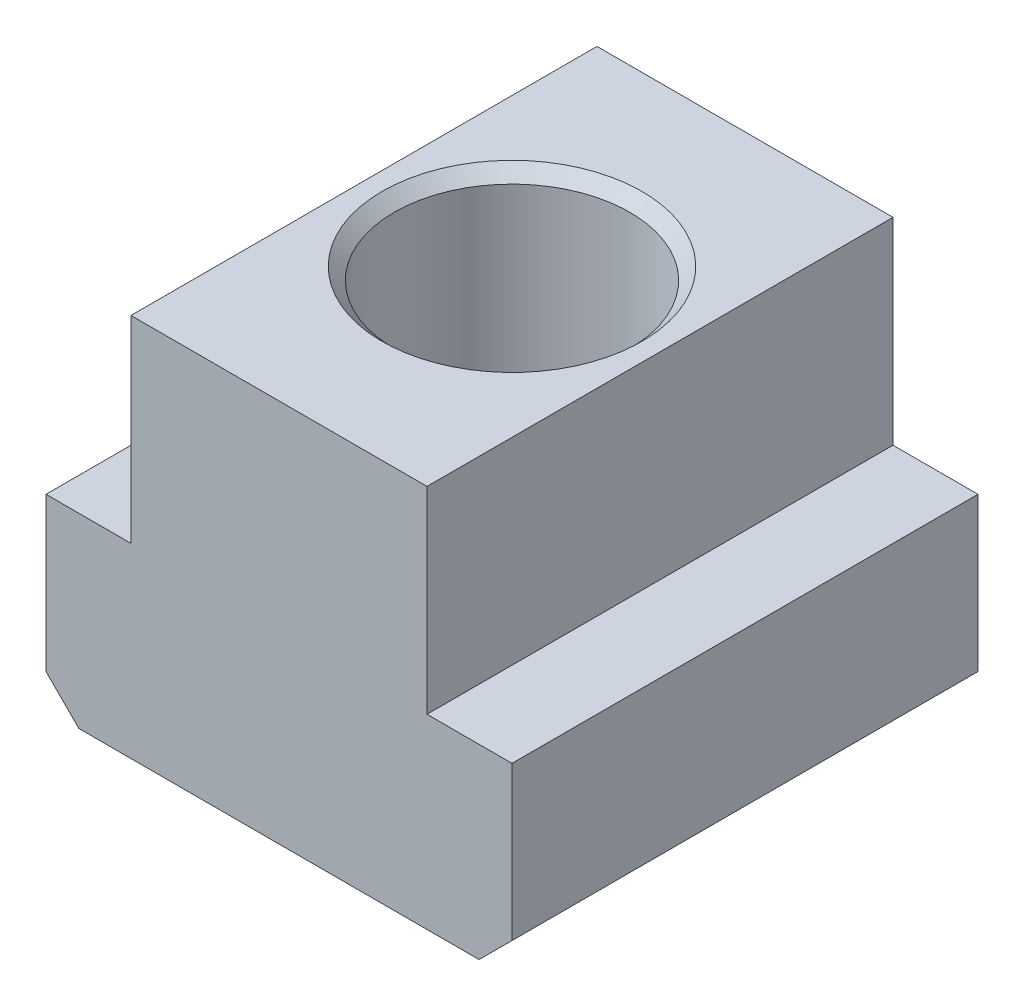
ISO-10303-21;
HEADER;
FILE_DESCRIPTION(('STEP AP214'),'2;1');
FILE_NAME('part.step','',(''),(''),'','','');
FILE_SCHEMA(('AUTOMOTIVE_DESIGN { 1 0 10303 214 1 1 1 1 }'));
ENDSEC;
DATA;
#1=APPLICATION_CONTEXT('core data for automotive mechanical design processes');
#2=APPLICATION_PROTOCOL_DEFINITION('international standard','automotive_design',2000,#1);
#3=PRODUCT_CONTEXT('',#1,'mechanical');
#4=PRODUCT('Part','Part','',(#3));
#5=PRODUCT_RELATED_PRODUCT_CATEGORY('part','',(#4));
#6=PRODUCT_DEFINITION_FORMATION('','',#4);
#7=PRODUCT_DEFINITION_CONTEXT('part definition',#1,'design');
#8=PRODUCT_DEFINITION('design','',#6,#7);
#9=PRODUCT_DEFINITION_SHAPE('','',#8);
#10=(LENGTH_UNIT() NAMED_UNIT(*) SI_UNIT(.MILLI.,.METRE.));
#11=(NAMED_UNIT(*) PLANE_ANGLE_UNIT() SI_UNIT($,.RADIAN.));
#12=(NAMED_UNIT(*) SI_UNIT($,.STERADIAN.) SOLID_ANGLE_UNIT());
#13=UNCERTAINTY_MEASURE_WITH_UNIT(LENGTH_MEASURE(1.E-05),#10,'distance_accuracy_value','');
#14=(GEOMETRIC_REPRESENTATION_CONTEXT(3) GLOBAL_UNCERTAINTY_ASSIGNED_CONTEXT((#13)) GLOBAL_UNIT_ASSIGNED_CONTEXT((#10,
#11,#12)) REPRESENTATION_CONTEXT('',''));
#15=CARTESIAN_POINT('',(0.,0.,0.));
#16=DIRECTION('',(0.,0.,1.));
#17=DIRECTION('',(1.,0.,0.));
#18=AXIS2_PLACEMENT_3D('',#15,#16,#17);
#19=CARTESIAN_POINT('',(-42.5,0.,-85.));
#20=DIRECTION('',(-1.,0.,0.));
#21=DIRECTION('',(0.,0.,1.));
#22=AXIS2_PLACEMENT_3D('',#19,#20,#21);
#23=PLANE('',#22);
#24=DIRECTION('',(0.,-1.,0.));
#25=VECTOR('',#24,1.);
#26=CARTESIAN_POINT('',(-42.5,0.,-85.));
#27=LINE('',#26,#25);
#28=CARTESIAN_POINT('',(-42.5,34.,-85.));
#29=VERTEX_POINT('',#28);
#30=CARTESIAN_POINT('',(-42.5,6.0000000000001,-85.));
#31=VERTEX_POINT('',#30);
#32=EDGE_CURVE('E173',#29,#31,#27,.T.);
#33=ORIENTED_EDGE('',*,*,#32,.T.);
#34=DIRECTION('',(0.,0.,1.));
#35=VECTOR('',#34,1.);
#36=CARTESIAN_POINT('',(-42.5,6.0000000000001,-85.));
#37=LINE('',#36,#35);
#38=CARTESIAN_POINT('',(-42.5,6.0000000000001,0.));
#39=VERTEX_POINT('',#38);
#40=EDGE_CURVE('E196',#31,#39,#37,.T.);
#41=ORIENTED_EDGE('',*,*,#40,.T.);
#42=DIRECTION('',(0.,-1.,0.));
#43=VECTOR('',#42,1.);
#44=CARTESIAN_POINT('',(-42.5,0.,0.));
#45=LINE('',#44,#43);
#46=CARTESIAN_POINT('',(-42.5,34.,0.));
#47=VERTEX_POINT('',#46);
#48=EDGE_CURVE('E152',#47,#39,#45,.T.);
#49=ORIENTED_EDGE('',*,*,#48,.F.);
#50=DIRECTION('',(0.,0.,1.));
#51=VECTOR('',#50,1.);
#52=CARTESIAN_POINT('',(-42.5,34.,-85.));
#53=LINE('',#52,#51);
#54=EDGE_CURVE('E174',#29,#47,#53,.T.);
#55=ORIENTED_EDGE('',*,*,#54,.F.);
#56=EDGE_LOOP('',(#33,#41,#49,#55));
#57=FACE_BOUND('',#56,.T.);
#58=ADVANCED_FACE('F39',(#57),#23,.T.);
#59=CARTESIAN_POINT('',(-42.5,34.,-85.));
#60=DIRECTION('',(0.,1.,0.));
#61=DIRECTION('',(0.,0.,1.));
#62=AXIS2_PLACEMENT_3D('',#59,#60,#61);
#63=PLANE('',#62);
#64=DIRECTION('',(-1.,0.,0.));
#65=VECTOR('',#64,1.);
#66=CARTESIAN_POINT('',(-42.5,34.,0.));
#67=LINE('',#66,#65);
#68=CARTESIAN_POINT('',(-27.,34.,0.));
#69=VERTEX_POINT('',#68);
#70=EDGE_CURVE('E170',#69,#47,#67,.T.);
#71=ORIENTED_EDGE('',*,*,#70,.F.);
#72=DIRECTION('',(0.,0.,1.));
#73=VECTOR('',#72,1.);
#74=CARTESIAN_POINT('',(-27.,34.,-85.));
#75=LINE('',#74,#73);
#76=CARTESIAN_POINT('',(-27.,34.,-85.));
#77=VERTEX_POINT('',#76);
#78=EDGE_CURVE('E177',#77,#69,#75,.T.);
#79=ORIENTED_EDGE('',*,*,#78,.F.);
#80=DIRECTION('',(-1.,0.,0.));
#81=VECTOR('',#80,1.);
#82=CARTESIAN_POINT('',(-42.5,34.,-85.));
#83=LINE('',#82,#81);
#84=EDGE_CURVE('E133',#77,#29,#83,.T.);
#85=ORIENTED_EDGE('',*,*,#84,.T.);
#86=ORIENTED_EDGE('',*,*,#54,.T.);
#87=EDGE_LOOP('',(#71,#79,#85,#86));
#88=FACE_BOUND('',#87,.T.);
#89=ADVANCED_FACE('F245',(#88),#63,.T.);
#90=CARTESIAN_POINT('',(-27.,34.,-85.));
#91=DIRECTION('',(-1.,0.,0.));
#92=DIRECTION('',(0.,0.,1.));
#93=AXIS2_PLACEMENT_3D('',#90,#91,#92);
#94=PLANE('',#93);
#95=DIRECTION('',(0.,-1.,0.));
#96=VECTOR('',#95,1.);
#97=CARTESIAN_POINT('',(-27.,34.,0.));
#98=LINE('',#97,#96);
#99=CARTESIAN_POINT('',(-27.,70.,0.));
#100=VERTEX_POINT('',#99);
#101=EDGE_CURVE('E167',#100,#69,#98,.T.);
#102=ORIENTED_EDGE('',*,*,#101,.F.);
#103=DIRECTION('',(0.,0.,1.));
#104=VECTOR('',#103,1.);
#105=CARTESIAN_POINT('',(-27.,70.,-85.));
#106=LINE('',#105,#104);
#107=CARTESIAN_POINT('',(-27.,70.,-85.));
#108=VERTEX_POINT('',#107);
#109=EDGE_CURVE('E179',#108,#100,#106,.T.);
#110=ORIENTED_EDGE('',*,*,#109,.F.);
#111=DIRECTION('',(0.,-1.,0.));
#112=VECTOR('',#111,1.);
#113=CARTESIAN_POINT('',(-27.,34.,-85.));
#114=LINE('',#113,#112);
#115=EDGE_CURVE('E147',#108,#77,#114,.T.);
#116=ORIENTED_EDGE('',*,*,#115,.T.);
#117=ORIENTED_EDGE('',*,*,#78,.T.);
#118=EDGE_LOOP('',(#102,#110,#116,#117));
#119=FACE_BOUND('',#118,.T.);
#120=ADVANCED_FACE('F262',(#119),#94,.T.);
#121=CARTESIAN_POINT('',(-27.,70.,-85.));
#122=DIRECTION('',(0.,1.,0.));
#123=DIRECTION('',(0.,0.,1.));
#124=AXIS2_PLACEMENT_3D('',#121,#122,#123);
#125=PLANE('',#124);
#126=CARTESIAN_POINT('',(0.,70.,-42.5));
#127=DIRECTION('',(0.,1.,0.));
#128=DIRECTION('',(0.,0.,1.));
#129=AXIS2_PLACEMENT_3D('',#126,#127,#128);
#130=CIRCLE('',#129,23.7);
#131=CARTESIAN_POINT('',(-23.7,70.,-42.5));
#132=VERTEX_POINT('',#131);
#133=EDGE_CURVE('E47',#132,#132,#130,.F.);
#134=ORIENTED_EDGE('',*,*,#133,.T.);
#135=EDGE_LOOP('',(#134));
#136=FACE_BOUND('',#135,.T.);
#137=DIRECTION('',(-1.,0.,0.));
#138=VECTOR('',#137,1.);
#139=CARTESIAN_POINT('',(-27.,70.,0.));
#140=LINE('',#139,#138);
#141=CARTESIAN_POINT('',(27.,70.,0.));
#142=VERTEX_POINT('',#141);
#143=EDGE_CURVE('E164',#142,#100,#140,.T.);
#144=ORIENTED_EDGE('',*,*,#143,.F.);
#145=DIRECTION('',(0.,0.,1.));
#146=VECTOR('',#145,1.);
#147=CARTESIAN_POINT('',(27.,70.,-85.));
#148=LINE('',#147,#146);
#149=CARTESIAN_POINT('',(27.,70.,-85.));
#150=VERTEX_POINT('',#149);
#151=EDGE_CURVE('E181',#150,#142,#148,.T.);
#152=ORIENTED_EDGE('',*,*,#151,.F.);
#153=DIRECTION('',(-1.,0.,0.));
#154=VECTOR('',#153,1.);
#155=CARTESIAN_POINT('',(-27.,70.,-85.));
#156=LINE('',#155,#154);
#157=EDGE_CURVE('E141',#150,#108,#156,.T.);
#158=ORIENTED_EDGE('',*,*,#157,.T.);
#159=ORIENTED_EDGE('',*,*,#109,.T.);
#160=EDGE_LOOP('',(#144,#152,#158,#159));
#161=FACE_BOUND('',#160,.T.);
#162=ADVANCED_FACE('F207',(#136,#161),#125,.T.);
#163=CARTESIAN_POINT('',(27.,34.,-85.));
#164=DIRECTION('',(1.,0.,0.));
#165=DIRECTION('',(0.,1.,0.));
#166=AXIS2_PLACEMENT_3D('',#163,#164,#165);
#167=PLANE('',#166);
#168=DIRECTION('',(0.,1.,0.));
#169=VECTOR('',#168,1.);
#170=CARTESIAN_POINT('',(27.,34.,0.));
#171=LINE('',#170,#169);
#172=CARTESIAN_POINT('',(27.,34.,0.));
#173=VERTEX_POINT('',#172);
#174=EDGE_CURVE('E161',#173,#142,#171,.T.);
#175=ORIENTED_EDGE('',*,*,#174,.F.);
#176=DIRECTION('',(0.,0.,1.));
#177=VECTOR('',#176,1.);
#178=CARTESIAN_POINT('',(27.,34.,-85.));
#179=LINE('',#178,#177);
#180=CARTESIAN_POINT('',(27.,34.,-85.));
#181=VERTEX_POINT('',#180);
#182=EDGE_CURVE('E132',#181,#173,#179,.T.);
#183=ORIENTED_EDGE('',*,*,#182,.F.);
#184=DIRECTION('',(0.,1.,0.));
#185=VECTOR('',#184,1.);
#186=CARTESIAN_POINT('',(27.,34.,-85.));
#187=LINE('',#186,#185);
#188=EDGE_CURVE('E139',#181,#150,#187,.T.);
#189=ORIENTED_EDGE('',*,*,#188,.T.);
#190=ORIENTED_EDGE('',*,*,#151,.T.);
#191=EDGE_LOOP('',(#175,#183,#189,#190));
#192=FACE_BOUND('',#191,.T.);
#193=ADVANCED_FACE('F253',(#192),#167,.T.);
#194=CARTESIAN_POINT('',(27.,34.,-85.));
#195=DIRECTION('',(0.,1.,0.));
#196=DIRECTION('',(0.,0.,1.));
#197=AXIS2_PLACEMENT_3D('',#194,#195,#196);
#198=PLANE('',#197);
#199=DIRECTION('',(-1.,0.,0.));
#200=VECTOR('',#199,1.);
#201=CARTESIAN_POINT('',(27.,34.,0.));
#202=LINE('',#201,#200);
#203=CARTESIAN_POINT('',(42.5,34.,0.));
#204=VERTEX_POINT('',#203);
#205=EDGE_CURVE('E131',#204,#173,#202,.T.);
#206=ORIENTED_EDGE('',*,*,#205,.F.);
#207=DIRECTION('',(0.,0.,1.));
#208=VECTOR('',#207,1.);
#209=CARTESIAN_POINT('',(42.5,34.,-85.));
#210=LINE('',#209,#208);
#211=CARTESIAN_POINT('',(42.5,34.,-85.));
#212=VERTEX_POINT('',#211);
#213=EDGE_CURVE('E120',#212,#204,#210,.T.);
#214=ORIENTED_EDGE('',*,*,#213,.F.);
#215=DIRECTION('',(-1.,0.,0.));
#216=VECTOR('',#215,1.);
#217=CARTESIAN_POINT('',(27.,34.,-85.));
#218=LINE('',#217,#216);
#219=EDGE_CURVE('E124',#212,#181,#218,.T.);
#220=ORIENTED_EDGE('',*,*,#219,.T.);
#221=ORIENTED_EDGE('',*,*,#182,.T.);
#222=EDGE_LOOP('',(#206,#214,#220,#221));
#223=FACE_BOUND('',#222,.T.);
#224=ADVANCED_FACE('F129',(#223),#198,.T.);
#225=CARTESIAN_POINT('',(42.5,0.,-85.));
#226=DIRECTION('',(1.,0.,0.));
#227=DIRECTION('',(0.,1.,0.));
#228=AXIS2_PLACEMENT_3D('',#225,#226,#227);
#229=PLANE('',#228);
#230=DIRECTION('',(0.,1.,0.));
#231=VECTOR('',#230,1.);
#232=CARTESIAN_POINT('',(42.5,0.,0.));
#233=LINE('',#232,#231);
#234=CARTESIAN_POINT('',(42.5,6.00000000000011,0.));
#235=VERTEX_POINT('',#234);
#236=EDGE_CURVE('E158',#235,#204,#233,.T.);
#237=ORIENTED_EDGE('',*,*,#236,.F.);
#238=DIRECTION('',(0.,0.,-1.));
#239=VECTOR('',#238,1.);
#240=CARTESIAN_POINT('',(42.5,6.00000000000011,-85.));
#241=LINE('',#240,#239);
#242=CARTESIAN_POINT('',(42.5,6.00000000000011,-85.));
#243=VERTEX_POINT('',#242);
#244=EDGE_CURVE('E62',#235,#243,#241,.T.);
#245=ORIENTED_EDGE('',*,*,#244,.T.);
#246=DIRECTION('',(0.,1.,0.));
#247=VECTOR('',#246,1.);
#248=CARTESIAN_POINT('',(42.5,0.,-85.));
#249=LINE('',#248,#247);
#250=EDGE_CURVE('E117',#243,#212,#249,.T.);
#251=ORIENTED_EDGE('',*,*,#250,.T.);
#252=ORIENTED_EDGE('',*,*,#213,.T.);
#253=EDGE_LOOP('',(#237,#245,#251,#252));
#254=FACE_BOUND('',#253,.T.);
#255=ADVANCED_FACE('F119',(#254),#229,.T.);
#256=CARTESIAN_POINT('',(-42.5,0.,-85.));
#257=DIRECTION('',(0.,-1.,0.));
#258=DIRECTION('',(1.,0.,0.));
#259=AXIS2_PLACEMENT_3D('',#256,#257,#258);
#260=PLANE('',#259);
#261=CARTESIAN_POINT('',(0.,0.,-42.5));
#262=DIRECTION('',(0.,-1.,0.));
#263=DIRECTION('',(1.,0.,0.));
#264=AXIS2_PLACEMENT_3D('',#261,#262,#263);
#265=CIRCLE('',#264,23.7);
#266=CARTESIAN_POINT('',(23.7,0.,-42.5));
#267=VERTEX_POINT('',#266);
#268=EDGE_CURVE('E11',#267,#267,#265,.F.);
#269=ORIENTED_EDGE('',*,*,#268,.T.);
#270=EDGE_LOOP('',(#269));
#271=FACE_BOUND('',#270,.T.);
#272=DIRECTION('',(1.,0.,0.));
#273=VECTOR('',#272,1.);
#274=CARTESIAN_POINT('',(-42.5,0.,-85.));
#275=LINE('',#274,#273);
#276=CARTESIAN_POINT('',(-36.5,0.,-85.));
#277=VERTEX_POINT('',#276);
#278=CARTESIAN_POINT('',(36.5,0.,-85.));
#279=VERTEX_POINT('',#278);
#280=EDGE_CURVE('E125',#277,#279,#275,.T.);
#281=ORIENTED_EDGE('',*,*,#280,.T.);
#282=DIRECTION('',(0.,0.,1.));
#283=VECTOR('',#282,1.);
#284=CARTESIAN_POINT('',(36.5,0.,-85.));
#285=LINE('',#284,#283);
#286=CARTESIAN_POINT('',(36.5,0.,0.));
#287=VERTEX_POINT('',#286);
#288=EDGE_CURVE('E185',#279,#287,#285,.T.);
#289=ORIENTED_EDGE('',*,*,#288,.T.);
#290=DIRECTION('',(1.,0.,0.));
#291=VECTOR('',#290,1.);
#292=CARTESIAN_POINT('',(-42.5,0.,0.));
#293=LINE('',#292,#291);
#294=CARTESIAN_POINT('',(-36.5,0.,0.));
#295=VERTEX_POINT('',#294);
#296=EDGE_CURVE('E155',#295,#287,#293,.T.);
#297=ORIENTED_EDGE('',*,*,#296,.F.);
#298=DIRECTION('',(0.,0.,-1.));
#299=VECTOR('',#298,1.);
#300=CARTESIAN_POINT('',(-36.5,0.,-85.));
#301=LINE('',#300,#299);
#302=EDGE_CURVE('E176',#295,#277,#301,.T.);
#303=ORIENTED_EDGE('',*,*,#302,.T.);
#304=EDGE_LOOP('',(#281,#289,#297,#303));
#305=FACE_BOUND('',#304,.T.);
#306=ADVANCED_FACE('F226',(#271,#305),#260,.T.);
#307=CARTESIAN_POINT('',(-42.5,34.,-85.));
#308=DIRECTION('',(0.,0.,-1.));
#309=DIRECTION('',(-1.,0.,0.));
#310=AXIS2_PLACEMENT_3D('',#307,#308,#309);
#311=PLANE('',#310);
#312=ORIENTED_EDGE('',*,*,#250,.F.);
#313=DIRECTION('',(0.707106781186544,0.707106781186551,0.));
#314=VECTOR('',#313,1.);
#315=CARTESIAN_POINT('',(14.0000000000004,-22.4999999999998,-85.));
#316=LINE('',#315,#314);
#317=EDGE_CURVE('E194',#243,#279,#316,.F.);
#318=ORIENTED_EDGE('',*,*,#317,.T.);
#319=ORIENTED_EDGE('',*,*,#280,.F.);
#320=DIRECTION('',(0.707106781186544,-0.707106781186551,0.));
#321=VECTOR('',#320,1.);
#322=CARTESIAN_POINT('',(-56.5,20.0000000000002,-85.));
#323=LINE('',#322,#321);
#324=EDGE_CURVE('E54',#277,#31,#323,.F.);
#325=ORIENTED_EDGE('',*,*,#324,.T.);
#326=ORIENTED_EDGE('',*,*,#32,.F.);
#327=ORIENTED_EDGE('',*,*,#84,.F.);
#328=ORIENTED_EDGE('',*,*,#115,.F.);
#329=ORIENTED_EDGE('',*,*,#157,.F.);
#330=ORIENTED_EDGE('',*,*,#188,.F.);
#331=ORIENTED_EDGE('',*,*,#219,.F.);
#332=EDGE_LOOP('',(#312,#318,#319,#325,#326,#327,#328,#329,#330,#331));
#333=FACE_BOUND('',#332,.T.);
#334=ADVANCED_FACE('F136',(#333),#311,.T.);
#335=CARTESIAN_POINT('',(-42.5,34.,0.));
#336=DIRECTION('',(0.,0.,-1.));
#337=DIRECTION('',(-1.,0.,0.));
#338=AXIS2_PLACEMENT_3D('',#335,#336,#337);
#339=PLANE('',#338);
#340=ORIENTED_EDGE('',*,*,#296,.T.);
#341=DIRECTION('',(-0.707106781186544,-0.707106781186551,0.));
#342=VECTOR('',#341,1.);
#343=CARTESIAN_POINT('',(36.5,0.,0.));
#344=LINE('',#343,#342);
#345=EDGE_CURVE('E190',#287,#235,#344,.F.);
#346=ORIENTED_EDGE('',*,*,#345,.T.);
#347=ORIENTED_EDGE('',*,*,#236,.T.);
#348=ORIENTED_EDGE('',*,*,#205,.T.);
#349=ORIENTED_EDGE('',*,*,#174,.T.);
#350=ORIENTED_EDGE('',*,*,#143,.T.);
#351=ORIENTED_EDGE('',*,*,#101,.T.);
#352=ORIENTED_EDGE('',*,*,#70,.T.);
#353=ORIENTED_EDGE('',*,*,#48,.T.);
#354=DIRECTION('',(-0.707106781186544,0.707106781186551,0.));
#355=VECTOR('',#354,1.);
#356=CARTESIAN_POINT('',(-42.5,6.0000000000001,0.));
#357=LINE('',#356,#355);
#358=EDGE_CURVE('E188',#39,#295,#357,.F.);
#359=ORIENTED_EDGE('',*,*,#358,.T.);
#360=EDGE_LOOP('',(#340,#346,#347,#348,#349,#350,#351,#352,#353,#359));
#361=FACE_BOUND('',#360,.T.);
#362=ADVANCED_FACE('F237',(#361),#339,.F.);
#363=CARTESIAN_POINT('',(36.5,0.,-85.));
#364=DIRECTION('',(-0.707106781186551,0.707106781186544,0.));
#365=DIRECTION('',(-0.707106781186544,-0.707106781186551,0.));
#366=AXIS2_PLACEMENT_3D('',#363,#364,#365);
#367=PLANE('',#366);
#368=ORIENTED_EDGE('',*,*,#317,.F.);
#369=ORIENTED_EDGE('',*,*,#244,.F.);
#370=ORIENTED_EDGE('',*,*,#345,.F.);
#371=ORIENTED_EDGE('',*,*,#288,.F.);
#372=EDGE_LOOP('',(#368,#369,#370,#371));
#373=FACE_BOUND('',#372,.T.);
#374=ADVANCED_FACE('F235',(#373),#367,.F.);
#375=CARTESIAN_POINT('',(-42.5,6.0000000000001,-85.));
#376=DIRECTION('',(0.707106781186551,0.707106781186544,0.));
#377=DIRECTION('',(-0.707106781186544,0.707106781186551,0.));
#378=AXIS2_PLACEMENT_3D('',#375,#376,#377);
#379=PLANE('',#378);
#380=ORIENTED_EDGE('',*,*,#324,.F.);
#381=ORIENTED_EDGE('',*,*,#302,.F.);
#382=ORIENTED_EDGE('',*,*,#358,.F.);
#383=ORIENTED_EDGE('',*,*,#40,.F.);
#384=EDGE_LOOP('',(#380,#381,#382,#383));
#385=FACE_BOUND('',#384,.T.);
#386=ADVANCED_FACE('F218',(#385),#379,.F.);
#387=CARTESIAN_POINT('',(0.,0.,-42.5));
#388=DIRECTION('',(0.,1.,0.));
#389=DIRECTION('',(-1.,0.,0.));
#390=AXIS2_PLACEMENT_3D('',#387,#388,#389);
#391=CYLINDRICAL_SURFACE('',#390,21.5);
#392=CARTESIAN_POINT('',(0.,67.8,-42.5));
#393=DIRECTION('',(0.,1.,0.));
#394=DIRECTION('',(-1.,0.,0.));
#395=AXIS2_PLACEMENT_3D('',#392,#393,#394);
#396=CIRCLE('',#395,21.5);
#397=CARTESIAN_POINT('',(-21.5,67.8,-42.5));
#398=VERTEX_POINT('',#397);
#399=EDGE_CURVE('E202',#398,#398,#396,.T.);
#400=ORIENTED_EDGE('',*,*,#399,.T.);
#401=EDGE_LOOP('',(#400));
#402=FACE_BOUND('',#401,.T.);
#403=CARTESIAN_POINT('',(0.,2.2,-42.5));
#404=DIRECTION('',(0.,-1.,0.));
#405=DIRECTION('',(1.,0.,0.));
#406=AXIS2_PLACEMENT_3D('',#403,#404,#405);
#407=CIRCLE('',#406,21.5);
#408=CARTESIAN_POINT('',(21.5,2.19999999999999,-42.5));
#409=VERTEX_POINT('',#408);
#410=EDGE_CURVE('E199',#409,#409,#407,.T.);
#411=ORIENTED_EDGE('',*,*,#410,.T.);
#412=EDGE_LOOP('',(#411));
#413=FACE_BOUND('',#412,.T.);
#414=ADVANCED_FACE('F213',(#402,#413),#391,.F.);
#415=CARTESIAN_POINT('',(0.,67.8,-42.5));
#416=DIRECTION('',(0.,1.,0.));
#417=DIRECTION('',(-1.,0.,0.));
#418=AXIS2_PLACEMENT_3D('',#415,#416,#417);
#419=CONICAL_SURFACE('',#418,21.5,0.785398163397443);
#420=CARTESIAN_POINT('',(-23.7,70.,-42.5));
#421=CARTESIAN_POINT('',(-23.6770833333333,69.9770833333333,-42.5));
#422=CARTESIAN_POINT('',(-23.6541666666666,69.9541666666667,-42.5));
#423=CARTESIAN_POINT('',(-23.6083333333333,69.9083333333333,-42.5));
#424=CARTESIAN_POINT('',(-23.5854166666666,69.8854166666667,-42.5));
#425=CARTESIAN_POINT('',(-23.5395833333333,69.8395833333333,-42.5));
#426=CARTESIAN_POINT('',(-23.5166666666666,69.8166666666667,-42.5));
#427=CARTESIAN_POINT('',(-23.4708333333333,69.7708333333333,-42.5));
#428=CARTESIAN_POINT('',(-23.4479166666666,69.7479166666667,-42.5));
#429=CARTESIAN_POINT('',(-23.4020833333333,69.7020833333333,-42.5));
#430=CARTESIAN_POINT('',(-23.3791666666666,69.6791666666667,-42.5));
#431=CARTESIAN_POINT('',(-23.3333333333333,69.6333333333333,-42.5));
#432=CARTESIAN_POINT('',(-23.3104166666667,69.6104166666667,-42.5));
#433=CARTESIAN_POINT('',(-23.2645833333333,69.5645833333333,-42.5));
#434=CARTESIAN_POINT('',(-23.2416666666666,69.5416666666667,-42.5));
#435=CARTESIAN_POINT('',(-23.1958333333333,69.4958333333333,-42.5));
#436=CARTESIAN_POINT('',(-23.1729166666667,69.4729166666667,-42.5));
#437=CARTESIAN_POINT('',(-23.1270833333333,69.4270833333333,-42.5));
#438=CARTESIAN_POINT('',(-23.1041666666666,69.4041666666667,-42.5));
#439=CARTESIAN_POINT('',(-23.0583333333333,69.3583333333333,-42.5));
#440=CARTESIAN_POINT('',(-23.0354166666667,69.3354166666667,-42.5));
#441=CARTESIAN_POINT('',(-22.9895833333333,69.2895833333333,-42.5));
#442=CARTESIAN_POINT('',(-22.9666666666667,69.2666666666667,-42.5));
#443=CARTESIAN_POINT('',(-22.9208333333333,69.2208333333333,-42.5));
#444=CARTESIAN_POINT('',(-22.8979166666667,69.1979166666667,-42.5));
#445=CARTESIAN_POINT('',(-22.8520833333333,69.1520833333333,-42.5));
#446=CARTESIAN_POINT('',(-22.8291666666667,69.1291666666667,-42.5));
#447=CARTESIAN_POINT('',(-22.7833333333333,69.0833333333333,-42.5));
#448=CARTESIAN_POINT('',(-22.7604166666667,69.0604166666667,-42.5));
#449=CARTESIAN_POINT('',(-22.7145833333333,69.0145833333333,-42.5));
#450=CARTESIAN_POINT('',(-22.6916666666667,68.9916666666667,-42.5));
#451=CARTESIAN_POINT('',(-22.6458333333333,68.9458333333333,-42.5));
#452=CARTESIAN_POINT('',(-22.6229166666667,68.9229166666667,-42.5));
#453=CARTESIAN_POINT('',(-22.5770833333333,68.8770833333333,-42.5));
#454=CARTESIAN_POINT('',(-22.5541666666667,68.8541666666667,-42.5));
#455=CARTESIAN_POINT('',(-22.5083333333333,68.8083333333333,-42.5));
#456=CARTESIAN_POINT('',(-22.4854166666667,68.7854166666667,-42.5));
#457=CARTESIAN_POINT('',(-22.4395833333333,68.7395833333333,-42.5));
#458=CARTESIAN_POINT('',(-22.4166666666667,68.7166666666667,-42.5));
#459=CARTESIAN_POINT('',(-22.3708333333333,68.6708333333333,-42.5));
#460=CARTESIAN_POINT('',(-22.3479166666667,68.6479166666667,-42.5));
#461=CARTESIAN_POINT('',(-22.3020833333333,68.6020833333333,-42.5));
#462=CARTESIAN_POINT('',(-22.2791666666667,68.5791666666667,-42.5));
#463=CARTESIAN_POINT('',(-22.2333333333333,68.5333333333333,-42.5));
#464=CARTESIAN_POINT('',(-22.2104166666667,68.5104166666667,-42.5));
#465=CARTESIAN_POINT('',(-22.1645833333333,68.4645833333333,-42.5));
#466=CARTESIAN_POINT('',(-22.1416666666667,68.4416666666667,-42.5));
#467=CARTESIAN_POINT('',(-22.0958333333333,68.3958333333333,-42.5));
#468=CARTESIAN_POINT('',(-22.0729166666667,68.3729166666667,-42.5));
#469=CARTESIAN_POINT('',(-22.0270833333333,68.3270833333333,-42.5));
#470=CARTESIAN_POINT('',(-22.0041666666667,68.3041666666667,-42.5));
#471=CARTESIAN_POINT('',(-21.9583333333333,68.2583333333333,-42.5));
#472=CARTESIAN_POINT('',(-21.9354166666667,68.2354166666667,-42.5));
#473=CARTESIAN_POINT('',(-21.8895833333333,68.1895833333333,-42.5));
#474=CARTESIAN_POINT('',(-21.8666666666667,68.1666666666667,-42.5));
#475=CARTESIAN_POINT('',(-21.8208333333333,68.1208333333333,-42.5));
#476=CARTESIAN_POINT('',(-21.7979166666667,68.0979166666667,-42.5));
#477=CARTESIAN_POINT('',(-21.7520833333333,68.0520833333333,-42.5));
#478=CARTESIAN_POINT('',(-21.7291666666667,68.0291666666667,-42.5));
#479=CARTESIAN_POINT('',(-21.6833333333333,67.9833333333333,-42.5));
#480=CARTESIAN_POINT('',(-21.6604166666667,67.9604166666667,-42.5));
#481=CARTESIAN_POINT('',(-21.6145833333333,67.9145833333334,-42.5));
#482=CARTESIAN_POINT('',(-21.5916666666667,67.8916666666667,-42.5));
#483=CARTESIAN_POINT('',(-21.5458333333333,67.8458333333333,-42.5));
#484=CARTESIAN_POINT('',(-21.5229166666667,67.8229166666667,-42.5));
#485=CARTESIAN_POINT('',(-21.5,67.8,-42.5));
#486=B_SPLINE_CURVE_WITH_KNOTS('',3,(#420,#421,#422,#423,#424,#425,#426,#427,#428,#429,#430,
#431,#432,#433,#434,#435,#436,#437,#438,#439,#440,#441,#442,#443,#444,#445,#446,#447,#448,#449,
#450,#451,#452,#453,#454,#455,#456,#457,#458,#459,#460,#461,#462,#463,#464,#465,#466,#467,#468,
#469,#470,#471,#472,#473,#474,#475,#476,#477,#478,#479,#480,#481,#482,#483,#484,#485),
.UNSPECIFIED.,.F.,.F.,(4,2,2,2,2,2,2,2,2,2,2,2,2,2,2,2,2,2,2,2,2,2,2,2,2,2,2,2,2,2,2,2,4),(0.,
0.0972271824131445,0.194454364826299,0.291681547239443,0.388908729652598,0.486135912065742,
0.583363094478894,0.680590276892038,0.777817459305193,0.875044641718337,0.972271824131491,
1.06949900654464,1.16672618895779,1.26395337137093,1.36118055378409,1.45840773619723,
1.55563491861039,1.65286210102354,1.75008928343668,1.84731646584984,1.94454364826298,
2.04177083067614,2.13899801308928,2.23622519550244,2.33345237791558,2.43067956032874,
2.52790674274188,2.62513392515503,2.72236110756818,2.81958828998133,2.91681547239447,
3.01404265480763,3.11126983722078),.UNSPECIFIED.);
#487=EDGE_CURVE('BSEAM210',#132,#398,#486,.T.);
#488=ORIENTED_EDGE('',*,*,#133,.F.);
#489=ORIENTED_EDGE('',*,*,#399,.F.);
#490=ORIENTED_EDGE('',*,*,#487,.T.);
#491=ORIENTED_EDGE('',*,*,#487,.F.);
#492=EDGE_LOOP('',(#488,#490,#489,#491));
#493=FACE_BOUND('',#492,.T.);
#494=ADVANCED_FACE('F210',(#493),#419,.F.);
#495=CARTESIAN_POINT('',(0.,0.,-42.5));
#496=DIRECTION('',(0.,-1.,0.));
#497=DIRECTION('',(1.,0.,0.));
#498=AXIS2_PLACEMENT_3D('',#495,#496,#497);
#499=CONICAL_SURFACE('',#498,23.7,0.785398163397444);
#500=ORIENTED_EDGE('',*,*,#410,.F.);
#501=EDGE_LOOP('',(#500));
#502=FACE_BOUND('',#501,.T.);
#503=ORIENTED_EDGE('',*,*,#268,.F.);
#504=EDGE_LOOP('',(#503));
#505=FACE_BOUND('',#504,.T.);
#506=ADVANCED_FACE('F41',(#502,#505),#499,.F.);
#507=CLOSED_SHELL('',(#58,#89,#120,#162,#193,#224,#255,#306,#334,#362,#374,#386,#414,#494,#506));
#508=MANIFOLD_SOLID_BREP('B2',#507);
#509=ADVANCED_BREP_SHAPE_REPRESENTATION('',(#18,#508),#14);
#510=SHAPE_DEFINITION_REPRESENTATION(#9,#509);
ENDSEC;
END-ISO-10303-21;
